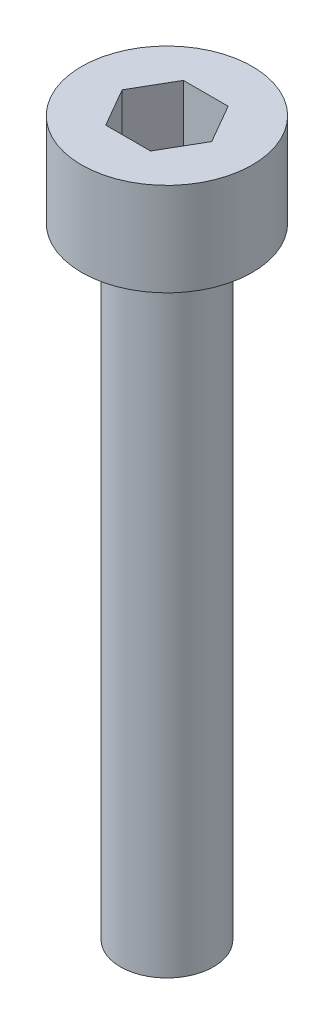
ISO-10303-21;
HEADER;
FILE_DESCRIPTION(('STEP AP214'),'2;1');
FILE_NAME('part.step','',(''),(''),'','','');
FILE_SCHEMA(('AUTOMOTIVE_DESIGN { 1 0 10303 214 1 1 1 1 }'));
ENDSEC;
DATA;
#1=APPLICATION_CONTEXT('core data for automotive mechanical design processes');
#2=APPLICATION_PROTOCOL_DEFINITION('international standard','automotive_design',2000,#1);
#3=PRODUCT_CONTEXT('',#1,'mechanical');
#4=PRODUCT('Part','Part','',(#3));
#5=PRODUCT_RELATED_PRODUCT_CATEGORY('part','',(#4));
#6=PRODUCT_DEFINITION_FORMATION('','',#4);
#7=PRODUCT_DEFINITION_CONTEXT('part definition',#1,'design');
#8=PRODUCT_DEFINITION('design','',#6,#7);
#9=PRODUCT_DEFINITION_SHAPE('','',#8);
#10=(LENGTH_UNIT() NAMED_UNIT(*) SI_UNIT(.MILLI.,.METRE.));
#11=(NAMED_UNIT(*) PLANE_ANGLE_UNIT() SI_UNIT($,.RADIAN.));
#12=(NAMED_UNIT(*) SI_UNIT($,.STERADIAN.) SOLID_ANGLE_UNIT());
#13=UNCERTAINTY_MEASURE_WITH_UNIT(LENGTH_MEASURE(1.E-05),#10,'distance_accuracy_value','');
#14=(GEOMETRIC_REPRESENTATION_CONTEXT(3) GLOBAL_UNCERTAINTY_ASSIGNED_CONTEXT((#13)) GLOBAL_UNIT_ASSIGNED_CONTEXT((#10,
#11,#12)) REPRESENTATION_CONTEXT('',''));
#15=CARTESIAN_POINT('',(0.,0.,0.));
#16=DIRECTION('',(0.,0.,1.));
#17=DIRECTION('',(1.,0.,0.));
#18=AXIS2_PLACEMENT_3D('',#15,#16,#17);
#19=CARTESIAN_POINT('',(1.5,-20.,0.));
#20=DIRECTION('',(0.,1.,0.));
#21=DIRECTION('',(0.,0.,1.));
#22=AXIS2_PLACEMENT_3D('',#19,#20,#21);
#23=PLANE('',#22);
#24=CARTESIAN_POINT('',(0.,-20.,0.));
#25=DIRECTION('',(0.,1.,0.));
#26=DIRECTION('',(0.,0.,1.));
#27=AXIS2_PLACEMENT_3D('',#24,#25,#26);
#28=CIRCLE('',#27,1.5);
#29=CARTESIAN_POINT('',(0.,-20.,1.5));
#30=VERTEX_POINT('',#29);
#31=EDGE_CURVE('E11',#30,#30,#28,.T.);
#32=ORIENTED_EDGE('',*,*,#31,.F.);
#33=EDGE_LOOP('',(#32));
#34=FACE_BOUND('',#33,.T.);
#35=ADVANCED_FACE('F41',(#34),#23,.F.);
#36=CARTESIAN_POINT('',(0.,9.90721096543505,0.));
#37=DIRECTION('',(0.,1.,0.));
#38=DIRECTION('',(0.,0.,1.));
#39=AXIS2_PLACEMENT_3D('',#36,#37,#38);
#40=CYLINDRICAL_SURFACE('',#39,1.5);
#41=CARTESIAN_POINT('',(0.,0.,0.));
#42=DIRECTION('',(0.,1.,0.));
#43=DIRECTION('',(0.,0.,1.));
#44=AXIS2_PLACEMENT_3D('',#41,#42,#43);
#45=CIRCLE('',#44,1.5);
#46=CARTESIAN_POINT('',(0.,0.,1.5));
#47=VERTEX_POINT('',#46);
#48=EDGE_CURVE('E48',#47,#47,#45,.T.);
#49=ORIENTED_EDGE('',*,*,#48,.F.);
#50=EDGE_LOOP('',(#49));
#51=FACE_BOUND('',#50,.T.);
#52=ORIENTED_EDGE('',*,*,#31,.T.);
#53=EDGE_LOOP('',(#52));
#54=FACE_BOUND('',#53,.T.);
#55=ADVANCED_FACE('F157',(#51,#54),#40,.T.);
#56=CARTESIAN_POINT('',(2.75,0.,0.));
#57=DIRECTION('',(0.,1.,0.));
#58=DIRECTION('',(0.,0.,1.));
#59=AXIS2_PLACEMENT_3D('',#56,#57,#58);
#60=PLANE('',#59);
#61=CARTESIAN_POINT('',(0.,0.,0.));
#62=DIRECTION('',(0.,1.,0.));
#63=DIRECTION('',(0.,0.,1.));
#64=AXIS2_PLACEMENT_3D('',#61,#62,#63);
#65=CIRCLE('',#64,2.75);
#66=CARTESIAN_POINT('',(0.,0.,2.75));
#67=VERTEX_POINT('',#66);
#68=EDGE_CURVE('E150',#67,#67,#65,.T.);
#69=ORIENTED_EDGE('',*,*,#68,.F.);
#70=EDGE_LOOP('',(#69));
#71=FACE_BOUND('',#70,.T.);
#72=ORIENTED_EDGE('',*,*,#48,.T.);
#73=EDGE_LOOP('',(#72));
#74=FACE_BOUND('',#73,.T.);
#75=ADVANCED_FACE('F155',(#71,#74),#60,.F.);
#76=CARTESIAN_POINT('',(0.,9.90721096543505,0.));
#77=DIRECTION('',(0.,1.,0.));
#78=DIRECTION('',(0.,0.,1.));
#79=AXIS2_PLACEMENT_3D('',#76,#77,#78);
#80=CYLINDRICAL_SURFACE('',#79,2.75);
#81=CARTESIAN_POINT('',(0.,3.,0.));
#82=DIRECTION('',(0.,1.,0.));
#83=DIRECTION('',(0.,0.,1.));
#84=AXIS2_PLACEMENT_3D('',#81,#82,#83);
#85=CIRCLE('',#84,2.75);
#86=CARTESIAN_POINT('',(0.,3.,2.75));
#87=VERTEX_POINT('',#86);
#88=EDGE_CURVE('E142',#87,#87,#85,.T.);
#89=ORIENTED_EDGE('',*,*,#88,.F.);
#90=EDGE_LOOP('',(#89));
#91=FACE_BOUND('',#90,.T.);
#92=ORIENTED_EDGE('',*,*,#68,.T.);
#93=EDGE_LOOP('',(#92));
#94=FACE_BOUND('',#93,.T.);
#95=ADVANCED_FACE('F177',(#91,#94),#80,.T.);
#96=CARTESIAN_POINT('',(0.,3.,0.));
#97=DIRECTION('',(0.,-1.,0.));
#98=DIRECTION('',(0.,0.,-1.));
#99=AXIS2_PLACEMENT_3D('',#96,#97,#98);
#100=PLANE('',#99);
#101=DIRECTION('',(-0.500000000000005,0.,-0.866025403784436));
#102=VECTOR('',#101,1.);
#103=CARTESIAN_POINT('',(1.44337567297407,3.,0.));
#104=LINE('',#103,#102);
#105=CARTESIAN_POINT('',(1.44337567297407,3.,0.));
#106=VERTEX_POINT('',#105);
#107=CARTESIAN_POINT('',(0.721687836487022,3.,-1.25));
#108=VERTEX_POINT('',#107);
#109=EDGE_CURVE('E129',#106,#108,#104,.T.);
#110=ORIENTED_EDGE('',*,*,#109,.F.);
#111=DIRECTION('',(0.499999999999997,0.,-0.866025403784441));
#112=VECTOR('',#111,1.);
#113=CARTESIAN_POINT('',(0.721687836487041,3.,1.25));
#114=LINE('',#113,#112);
#115=CARTESIAN_POINT('',(0.721687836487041,3.,1.25));
#116=VERTEX_POINT('',#115);
#117=EDGE_CURVE('E55',#116,#106,#114,.T.);
#118=ORIENTED_EDGE('',*,*,#117,.F.);
#119=DIRECTION('',(1.,0.,0.));
#120=VECTOR('',#119,1.);
#121=CARTESIAN_POINT('',(-0.721687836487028,3.,1.25));
#122=LINE('',#121,#120);
#123=CARTESIAN_POINT('',(-0.721687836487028,3.,1.25));
#124=VERTEX_POINT('',#123);
#125=EDGE_CURVE('E138',#124,#116,#122,.T.);
#126=ORIENTED_EDGE('',*,*,#125,.F.);
#127=DIRECTION('',(0.500000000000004,0.,0.866025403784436));
#128=VECTOR('',#127,1.);
#129=CARTESIAN_POINT('',(-1.44337567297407,3.,0.));
#130=LINE('',#129,#128);
#131=CARTESIAN_POINT('',(-1.44337567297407,3.,0.));
#132=VERTEX_POINT('',#131);
#133=EDGE_CURVE('E136',#132,#124,#130,.T.);
#134=ORIENTED_EDGE('',*,*,#133,.F.);
#135=DIRECTION('',(-0.499999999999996,0.,0.866025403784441));
#136=VECTOR('',#135,1.);
#137=CARTESIAN_POINT('',(-0.721687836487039,3.,-1.25));
#138=LINE('',#137,#136);
#139=CARTESIAN_POINT('',(-0.721687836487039,3.,-1.25));
#140=VERTEX_POINT('',#139);
#141=EDGE_CURVE('E103',#140,#132,#138,.T.);
#142=ORIENTED_EDGE('',*,*,#141,.F.);
#143=DIRECTION('',(-1.,0.,0.));
#144=VECTOR('',#143,1.);
#145=CARTESIAN_POINT('',(0.721687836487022,3.,-1.25));
#146=LINE('',#145,#144);
#147=EDGE_CURVE('E132',#108,#140,#146,.T.);
#148=ORIENTED_EDGE('',*,*,#147,.F.);
#149=EDGE_LOOP('',(#110,#118,#126,#134,#142,#148));
#150=FACE_BOUND('',#149,.T.);
#151=ORIENTED_EDGE('',*,*,#88,.T.);
#152=EDGE_LOOP('',(#151));
#153=FACE_BOUND('',#152,.T.);
#154=ADVANCED_FACE('F186',(#150,#153),#100,.F.);
#155=CARTESIAN_POINT('',(0.721687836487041,0.5,1.25));
#156=DIRECTION('',(0.86602540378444,0.,0.499999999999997));
#157=DIRECTION('',(0.499999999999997,0.,-0.86602540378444));
#158=AXIS2_PLACEMENT_3D('',#155,#156,#157);
#159=PLANE('',#158);
#160=ORIENTED_EDGE('',*,*,#117,.T.);
#161=DIRECTION('',(0.,1.,0.));
#162=VECTOR('',#161,1.);
#163=CARTESIAN_POINT('',(1.44337567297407,0.5,0.));
#164=LINE('',#163,#162);
#165=CARTESIAN_POINT('',(1.44337567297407,0.5,0.));
#166=VERTEX_POINT('',#165);
#167=EDGE_CURVE('E85',#166,#106,#164,.T.);
#168=ORIENTED_EDGE('',*,*,#167,.F.);
#169=DIRECTION('',(0.499999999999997,0.,-0.866025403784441));
#170=VECTOR('',#169,1.);
#171=CARTESIAN_POINT('',(0.721687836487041,0.5,1.25));
#172=LINE('',#171,#170);
#173=CARTESIAN_POINT('',(0.721687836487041,0.5,1.25));
#174=VERTEX_POINT('',#173);
#175=EDGE_CURVE('E140',#174,#166,#172,.T.);
#176=ORIENTED_EDGE('',*,*,#175,.F.);
#177=DIRECTION('',(0.,1.,0.));
#178=VECTOR('',#177,1.);
#179=CARTESIAN_POINT('',(0.721687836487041,0.5,1.25));
#180=LINE('',#179,#178);
#181=EDGE_CURVE('E63',#174,#116,#180,.T.);
#182=ORIENTED_EDGE('',*,*,#181,.T.);
#183=EDGE_LOOP('',(#160,#168,#176,#182));
#184=FACE_BOUND('',#183,.T.);
#185=ADVANCED_FACE('F195',(#184),#159,.F.);
#186=CARTESIAN_POINT('',(-0.721687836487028,0.5,1.25));
#187=DIRECTION('',(0.,0.,1.));
#188=DIRECTION('',(1.,0.,0.));
#189=AXIS2_PLACEMENT_3D('',#186,#187,#188);
#190=PLANE('',#189);
#191=ORIENTED_EDGE('',*,*,#125,.T.);
#192=ORIENTED_EDGE('',*,*,#181,.F.);
#193=DIRECTION('',(1.,0.,0.));
#194=VECTOR('',#193,1.);
#195=CARTESIAN_POINT('',(-0.721687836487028,0.5,1.25));
#196=LINE('',#195,#194);
#197=CARTESIAN_POINT('',(-0.721687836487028,0.5,1.25));
#198=VERTEX_POINT('',#197);
#199=EDGE_CURVE('E115',#198,#174,#196,.T.);
#200=ORIENTED_EDGE('',*,*,#199,.F.);
#201=DIRECTION('',(0.,1.,0.));
#202=VECTOR('',#201,1.);
#203=CARTESIAN_POINT('',(-0.721687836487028,0.5,1.25));
#204=LINE('',#203,#202);
#205=EDGE_CURVE('E107',#198,#124,#204,.T.);
#206=ORIENTED_EDGE('',*,*,#205,.T.);
#207=EDGE_LOOP('',(#191,#192,#200,#206));
#208=FACE_BOUND('',#207,.T.);
#209=ADVANCED_FACE('F204',(#208),#190,.F.);
#210=CARTESIAN_POINT('',(-1.44337567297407,0.5,0.));
#211=DIRECTION('',(-0.866025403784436,0.,0.500000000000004));
#212=DIRECTION('',(0.500000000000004,0.,0.866025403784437));
#213=AXIS2_PLACEMENT_3D('',#210,#211,#212);
#214=PLANE('',#213);
#215=ORIENTED_EDGE('',*,*,#133,.T.);
#216=ORIENTED_EDGE('',*,*,#205,.F.);
#217=DIRECTION('',(0.500000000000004,0.,0.866025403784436));
#218=VECTOR('',#217,1.);
#219=CARTESIAN_POINT('',(-1.44337567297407,0.5,0.));
#220=LINE('',#219,#218);
#221=CARTESIAN_POINT('',(-1.44337567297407,0.5,0.));
#222=VERTEX_POINT('',#221);
#223=EDGE_CURVE('E111',#222,#198,#220,.T.);
#224=ORIENTED_EDGE('',*,*,#223,.F.);
#225=DIRECTION('',(0.,1.,0.));
#226=VECTOR('',#225,1.);
#227=CARTESIAN_POINT('',(-1.44337567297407,0.5,0.));
#228=LINE('',#227,#226);
#229=EDGE_CURVE('E96',#222,#132,#228,.T.);
#230=ORIENTED_EDGE('',*,*,#229,.T.);
#231=EDGE_LOOP('',(#215,#216,#224,#230));
#232=FACE_BOUND('',#231,.T.);
#233=ADVANCED_FACE('F112',(#232),#214,.F.);
#234=CARTESIAN_POINT('',(-0.721687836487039,0.5,-1.25));
#235=DIRECTION('',(-0.866025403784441,0.,-0.499999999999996));
#236=DIRECTION('',(-0.499999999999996,0.,0.866025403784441));
#237=AXIS2_PLACEMENT_3D('',#234,#235,#236);
#238=PLANE('',#237);
#239=ORIENTED_EDGE('',*,*,#141,.T.);
#240=ORIENTED_EDGE('',*,*,#229,.F.);
#241=DIRECTION('',(-0.499999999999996,0.,0.866025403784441));
#242=VECTOR('',#241,1.);
#243=CARTESIAN_POINT('',(-0.721687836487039,0.5,-1.25));
#244=LINE('',#243,#242);
#245=CARTESIAN_POINT('',(-0.721687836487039,0.5,-1.25));
#246=VERTEX_POINT('',#245);
#247=EDGE_CURVE('E100',#246,#222,#244,.T.);
#248=ORIENTED_EDGE('',*,*,#247,.F.);
#249=DIRECTION('',(0.,1.,0.));
#250=VECTOR('',#249,1.);
#251=CARTESIAN_POINT('',(-0.721687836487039,0.5,-1.25));
#252=LINE('',#251,#250);
#253=EDGE_CURVE('E108',#246,#140,#252,.T.);
#254=ORIENTED_EDGE('',*,*,#253,.T.);
#255=EDGE_LOOP('',(#239,#240,#248,#254));
#256=FACE_BOUND('',#255,.T.);
#257=ADVANCED_FACE('F98',(#256),#238,.F.);
#258=CARTESIAN_POINT('',(0.721687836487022,0.5,-1.25));
#259=DIRECTION('',(0.,0.,-1.));
#260=DIRECTION('',(-1.,0.,0.));
#261=AXIS2_PLACEMENT_3D('',#258,#259,#260);
#262=PLANE('',#261);
#263=ORIENTED_EDGE('',*,*,#147,.T.);
#264=ORIENTED_EDGE('',*,*,#253,.F.);
#265=DIRECTION('',(-1.,0.,0.));
#266=VECTOR('',#265,1.);
#267=CARTESIAN_POINT('',(0.721687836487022,0.5,-1.25));
#268=LINE('',#267,#266);
#269=CARTESIAN_POINT('',(0.721687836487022,0.5,-1.25));
#270=VERTEX_POINT('',#269);
#271=EDGE_CURVE('E121',#270,#246,#268,.T.);
#272=ORIENTED_EDGE('',*,*,#271,.F.);
#273=DIRECTION('',(0.,1.,0.));
#274=VECTOR('',#273,1.);
#275=CARTESIAN_POINT('',(0.721687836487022,0.5,-1.25));
#276=LINE('',#275,#274);
#277=EDGE_CURVE('E145',#270,#108,#276,.T.);
#278=ORIENTED_EDGE('',*,*,#277,.T.);
#279=EDGE_LOOP('',(#263,#264,#272,#278));
#280=FACE_BOUND('',#279,.T.);
#281=ADVANCED_FACE('F226',(#280),#262,.F.);
#282=CARTESIAN_POINT('',(1.44337567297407,0.5,0.));
#283=DIRECTION('',(0.866025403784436,0.,-0.500000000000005));
#284=DIRECTION('',(-0.500000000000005,0.,-0.866025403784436));
#285=AXIS2_PLACEMENT_3D('',#282,#283,#284);
#286=PLANE('',#285);
#287=ORIENTED_EDGE('',*,*,#109,.T.);
#288=ORIENTED_EDGE('',*,*,#277,.F.);
#289=DIRECTION('',(-0.500000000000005,0.,-0.866025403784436));
#290=VECTOR('',#289,1.);
#291=CARTESIAN_POINT('',(1.44337567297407,0.5,0.));
#292=LINE('',#291,#290);
#293=EDGE_CURVE('E123',#166,#270,#292,.T.);
#294=ORIENTED_EDGE('',*,*,#293,.F.);
#295=ORIENTED_EDGE('',*,*,#167,.T.);
#296=EDGE_LOOP('',(#287,#288,#294,#295));
#297=FACE_BOUND('',#296,.T.);
#298=ADVANCED_FACE('F234',(#297),#286,.F.);
#299=CARTESIAN_POINT('',(0.,0.5,0.));
#300=DIRECTION('',(0.,1.,0.));
#301=DIRECTION('',(0.,0.,1.));
#302=AXIS2_PLACEMENT_3D('',#299,#300,#301);
#303=PLANE('',#302);
#304=ORIENTED_EDGE('',*,*,#175,.T.);
#305=ORIENTED_EDGE('',*,*,#293,.T.);
#306=ORIENTED_EDGE('',*,*,#271,.T.);
#307=ORIENTED_EDGE('',*,*,#247,.T.);
#308=ORIENTED_EDGE('',*,*,#223,.T.);
#309=ORIENTED_EDGE('',*,*,#199,.T.);
#310=EDGE_LOOP('',(#304,#305,#306,#307,#308,#309));
#311=FACE_BOUND('',#310,.T.);
#312=ADVANCED_FACE('F118',(#311),#303,.T.);
#313=CLOSED_SHELL('',(#35,#55,#75,#95,#154,#185,#209,#233,#257,#281,#298,#312));
#314=MANIFOLD_SOLID_BREP('B2',#313);
#315=ADVANCED_BREP_SHAPE_REPRESENTATION('',(#18,#314),#14);
#316=SHAPE_DEFINITION_REPRESENTATION(#9,#315);
ENDSEC;
END-ISO-10303-21;
